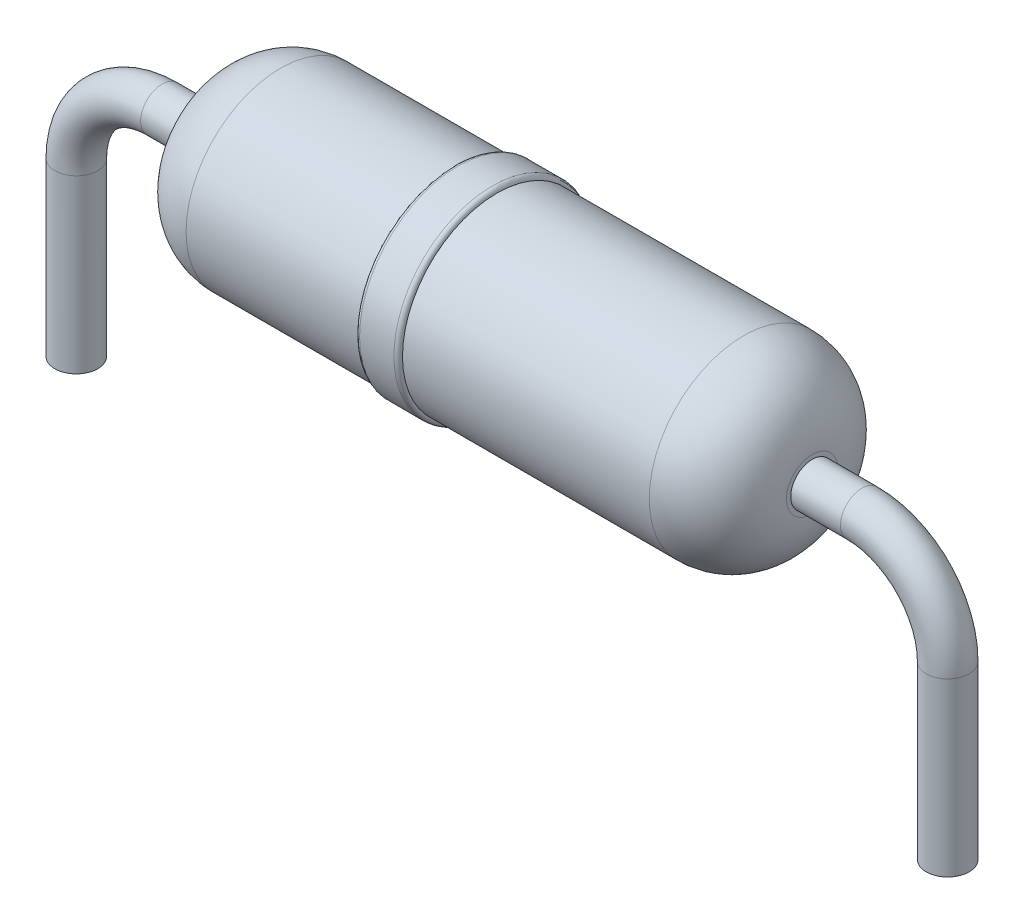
ISO-10303-21;
HEADER;
FILE_DESCRIPTION(('STEP AP214'),'2;1');
FILE_NAME('part.step','',(''),(''),'','','');
FILE_SCHEMA(('AUTOMOTIVE_DESIGN { 1 0 10303 214 1 1 1 1 }'));
ENDSEC;
DATA;
#1=APPLICATION_CONTEXT('core data for automotive mechanical design processes');
#2=APPLICATION_PROTOCOL_DEFINITION('international standard','automotive_design',2000,#1);
#3=PRODUCT_CONTEXT('',#1,'mechanical');
#4=PRODUCT('Part','Part','',(#3));
#5=PRODUCT_RELATED_PRODUCT_CATEGORY('part','',(#4));
#6=PRODUCT_DEFINITION_FORMATION('','',#4);
#7=PRODUCT_DEFINITION_CONTEXT('part definition',#1,'design');
#8=PRODUCT_DEFINITION('design','',#6,#7);
#9=PRODUCT_DEFINITION_SHAPE('','',#8);
#10=(LENGTH_UNIT() NAMED_UNIT(*) SI_UNIT(.MILLI.,.METRE.));
#11=(NAMED_UNIT(*) PLANE_ANGLE_UNIT() SI_UNIT($,.RADIAN.));
#12=(NAMED_UNIT(*) SI_UNIT($,.STERADIAN.) SOLID_ANGLE_UNIT());
#13=UNCERTAINTY_MEASURE_WITH_UNIT(LENGTH_MEASURE(1.E-05),#10,'distance_accuracy_value','');
#14=(GEOMETRIC_REPRESENTATION_CONTEXT(3) GLOBAL_UNCERTAINTY_ASSIGNED_CONTEXT((#13)) GLOBAL_UNIT_ASSIGNED_CONTEXT((#10,
#11,#12)) REPRESENTATION_CONTEXT('',''));
#15=CARTESIAN_POINT('',(0.,0.,0.));
#16=DIRECTION('',(0.,0.,1.));
#17=DIRECTION('',(1.,0.,0.));
#18=AXIS2_PLACEMENT_3D('',#15,#16,#17);
#19=CARTESIAN_POINT('',(-3.5,0.,0.));
#20=DIRECTION('',(1.,0.,0.));
#21=DIRECTION('',(0.,0.,-1.));
#22=AXIS2_PLACEMENT_3D('',#19,#20,#21);
#23=PLANE('',#22);
#24=CARTESIAN_POINT('',(-3.5,0.,0.));
#25=DIRECTION('',(-1.,0.,0.));
#26=DIRECTION('',(0.,0.,1.));
#27=AXIS2_PLACEMENT_3D('',#24,#25,#26);
#28=CIRCLE('',#27,0.299999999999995);
#29=CARTESIAN_POINT('',(-3.5,0.,0.299999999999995));
#30=VERTEX_POINT('',#29);
#31=EDGE_CURVE('E60',#30,#30,#28,.T.);
#32=ORIENTED_EDGE('',*,*,#31,.T.);
#33=EDGE_LOOP('',(#32));
#34=FACE_BOUND('',#33,.T.);
#35=CARTESIAN_POINT('',(-3.5,0.,0.));
#36=DIRECTION('',(1.,0.,0.));
#37=DIRECTION('',(0.,0.,-1.));
#38=AXIS2_PLACEMENT_3D('',#35,#36,#37);
#39=CIRCLE('',#38,0.25);
#40=CARTESIAN_POINT('',(-3.5,0.,-0.25));
#41=VERTEX_POINT('',#40);
#42=EDGE_CURVE('E10',#41,#41,#39,.F.);
#43=ORIENTED_EDGE('',*,*,#42,.F.);
#44=EDGE_LOOP('',(#43));
#45=FACE_BOUND('',#44,.T.);
#46=ADVANCED_FACE('F39',(#34,#45),#23,.F.);
#47=CARTESIAN_POINT('',(-54.2686615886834,0.,0.));
#48=DIRECTION('',(-1.,0.,0.));
#49=DIRECTION('',(0.,0.,1.));
#50=AXIS2_PLACEMENT_3D('',#47,#48,#49);
#51=CYLINDRICAL_SURFACE('',#50,1.1);
#52=CARTESIAN_POINT('',(-0.177024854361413,0.,0.));
#53=DIRECTION('',(1.,0.,0.));
#54=DIRECTION('',(0.,0.,-1.));
#55=AXIS2_PLACEMENT_3D('',#52,#53,#54);
#56=CIRCLE('',#55,1.1);
#57=CARTESIAN_POINT('',(-0.177024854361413,0.,-1.1));
#58=VERTEX_POINT('',#57);
#59=EDGE_CURVE('E57',#58,#58,#56,.T.);
#60=ORIENTED_EDGE('',*,*,#59,.T.);
#61=EDGE_LOOP('',(#60));
#62=FACE_BOUND('',#61,.T.);
#63=CARTESIAN_POINT('',(2.69999999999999,0.,0.));
#64=DIRECTION('',(-1.,0.,0.));
#65=DIRECTION('',(0.,0.,1.));
#66=AXIS2_PLACEMENT_3D('',#63,#64,#65);
#67=CIRCLE('',#66,1.1);
#68=CARTESIAN_POINT('',(2.69999999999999,0.,1.1));
#69=VERTEX_POINT('',#68);
#70=EDGE_CURVE('E67',#69,#69,#67,.T.);
#71=ORIENTED_EDGE('',*,*,#70,.T.);
#72=EDGE_LOOP('',(#71));
#73=FACE_BOUND('',#72,.T.);
#74=ADVANCED_FACE('F120',(#62,#73),#51,.T.);
#75=CARTESIAN_POINT('',(3.5,0.299999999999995,0.));
#76=DIRECTION('',(-1.,0.,0.));
#77=DIRECTION('',(0.,0.,1.));
#78=AXIS2_PLACEMENT_3D('',#75,#76,#77);
#79=PLANE('',#78);
#80=CARTESIAN_POINT('',(3.5,0.,0.));
#81=DIRECTION('',(-1.,0.,0.));
#82=DIRECTION('',(0.,0.,1.));
#83=AXIS2_PLACEMENT_3D('',#80,#81,#82);
#84=CIRCLE('',#83,0.25);
#85=CARTESIAN_POINT('',(3.5,0.,0.25));
#86=VERTEX_POINT('',#85);
#87=EDGE_CURVE('E90',#86,#86,#84,.T.);
#88=ORIENTED_EDGE('',*,*,#87,.T.);
#89=EDGE_LOOP('',(#88));
#90=FACE_BOUND('',#89,.T.);
#91=CARTESIAN_POINT('',(3.5,0.,0.));
#92=DIRECTION('',(-1.,0.,0.));
#93=DIRECTION('',(0.,0.,1.));
#94=AXIS2_PLACEMENT_3D('',#91,#92,#93);
#95=CIRCLE('',#94,0.299999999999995);
#96=CARTESIAN_POINT('',(3.5,0.,0.299999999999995));
#97=VERTEX_POINT('',#96);
#98=EDGE_CURVE('E54',#97,#97,#95,.T.);
#99=ORIENTED_EDGE('',*,*,#98,.F.);
#100=EDGE_LOOP('',(#99));
#101=FACE_BOUND('',#100,.T.);
#102=ADVANCED_FACE('F126',(#90,#101),#79,.F.);
#103=CARTESIAN_POINT('',(2.7,0.,0.));
#104=DIRECTION('',(-1.,0.,0.));
#105=DIRECTION('',(0.,0.,1.));
#106=AXIS2_PLACEMENT_3D('',#103,#104,#105);
#107=DEGENERATE_TOROIDAL_SURFACE('',#106,0.3,0.8,.T.);
#108=ORIENTED_EDGE('',*,*,#70,.F.);
#109=EDGE_LOOP('',(#108));
#110=FACE_BOUND('',#109,.T.);
#111=ORIENTED_EDGE('',*,*,#98,.T.);
#112=EDGE_LOOP('',(#111));
#113=FACE_BOUND('',#112,.T.);
#114=ADVANCED_FACE('F142',(#110,#113),#107,.T.);
#115=CARTESIAN_POINT('',(4.3261723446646,0.,0.));
#116=DIRECTION('',(1.,0.,0.));
#117=DIRECTION('',(0.,0.,-1.));
#118=AXIS2_PLACEMENT_3D('',#115,#116,#117);
#119=CYLINDRICAL_SURFACE('',#118,1.15);
#120=CARTESIAN_POINT('',(-0.627024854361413,0.,0.));
#121=DIRECTION('',(-1.,0.,0.));
#122=DIRECTION('',(0.,0.,1.));
#123=AXIS2_PLACEMENT_3D('',#120,#121,#122);
#124=CIRCLE('',#123,1.15);
#125=CARTESIAN_POINT('',(-0.627024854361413,0.,1.15));
#126=VERTEX_POINT('',#125);
#127=EDGE_CURVE('E46',#126,#126,#124,.F.);
#128=ORIENTED_EDGE('',*,*,#127,.T.);
#129=EDGE_LOOP('',(#128));
#130=FACE_BOUND('',#129,.T.);
#131=CARTESIAN_POINT('',(-0.227024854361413,0.,0.));
#132=DIRECTION('',(1.,0.,0.));
#133=DIRECTION('',(0.,0.,-1.));
#134=AXIS2_PLACEMENT_3D('',#131,#132,#133);
#135=CIRCLE('',#134,1.15);
#136=CARTESIAN_POINT('',(-0.227024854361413,0.,-1.15));
#137=VERTEX_POINT('',#136);
#138=EDGE_CURVE('E50',#137,#137,#135,.F.);
#139=ORIENTED_EDGE('',*,*,#138,.T.);
#140=EDGE_LOOP('',(#139));
#141=FACE_BOUND('',#140,.T.);
#142=ADVANCED_FACE('F133',(#130,#141),#119,.T.);
#143=CARTESIAN_POINT('',(-2.7,0.,0.));
#144=DIRECTION('',(-1.,0.,0.));
#145=DIRECTION('',(0.,0.,1.));
#146=AXIS2_PLACEMENT_3D('',#143,#144,#145);
#147=DEGENERATE_TOROIDAL_SURFACE('',#146,0.3,0.8,.T.);
#148=ORIENTED_EDGE('',*,*,#31,.F.);
#149=EDGE_LOOP('',(#148));
#150=FACE_BOUND('',#149,.T.);
#151=CARTESIAN_POINT('',(-2.69999999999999,0.,0.));
#152=DIRECTION('',(-1.,0.,0.));
#153=DIRECTION('',(0.,0.,1.));
#154=AXIS2_PLACEMENT_3D('',#151,#152,#153);
#155=CIRCLE('',#154,1.1);
#156=CARTESIAN_POINT('',(-2.69999999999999,0.,1.1));
#157=VERTEX_POINT('',#156);
#158=EDGE_CURVE('E70',#157,#157,#155,.T.);
#159=ORIENTED_EDGE('',*,*,#158,.T.);
#160=EDGE_LOOP('',(#159));
#161=FACE_BOUND('',#160,.T.);
#162=ADVANCED_FACE('F135',(#150,#161),#147,.T.);
#163=CARTESIAN_POINT('',(-0.677024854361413,0.,0.));
#164=DIRECTION('',(-1.,0.,0.));
#165=DIRECTION('',(0.,0.,1.));
#166=AXIS2_PLACEMENT_3D('',#163,#164,#165);
#167=CIRCLE('',#166,1.1);
#168=CARTESIAN_POINT('',(-0.677024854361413,0.,1.1));
#169=VERTEX_POINT('',#168);
#170=EDGE_CURVE('E61',#169,#169,#167,.T.);
#171=ORIENTED_EDGE('',*,*,#170,.T.);
#172=EDGE_LOOP('',(#171));
#173=FACE_BOUND('',#172,.T.);
#174=ORIENTED_EDGE('',*,*,#158,.F.);
#175=EDGE_LOOP('',(#174));
#176=FACE_BOUND('',#175,.T.);
#177=ADVANCED_FACE('F129',(#173,#176),#51,.T.);
#178=CARTESIAN_POINT('',(-0.627024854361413,0.,0.));
#179=DIRECTION('',(-1.,0.,0.));
#180=DIRECTION('',(0.,0.,1.));
#181=AXIS2_PLACEMENT_3D('',#178,#179,#180);
#182=TOROIDAL_SURFACE('',#181,1.1,0.05);
#183=ORIENTED_EDGE('',*,*,#170,.F.);
#184=EDGE_LOOP('',(#183));
#185=FACE_BOUND('',#184,.T.);
#186=ORIENTED_EDGE('',*,*,#127,.F.);
#187=EDGE_LOOP('',(#186));
#188=FACE_BOUND('',#187,.T.);
#189=ADVANCED_FACE('F140',(#185,#188),#182,.T.);
#190=CARTESIAN_POINT('',(-0.227024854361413,0.,0.));
#191=DIRECTION('',(1.,0.,0.));
#192=DIRECTION('',(0.,0.,-1.));
#193=AXIS2_PLACEMENT_3D('',#190,#191,#192);
#194=TOROIDAL_SURFACE('',#193,1.1,0.05);
#195=ORIENTED_EDGE('',*,*,#138,.F.);
#196=EDGE_LOOP('',(#195));
#197=FACE_BOUND('',#196,.T.);
#198=ORIENTED_EDGE('',*,*,#59,.F.);
#199=EDGE_LOOP('',(#198));
#200=FACE_BOUND('',#199,.T.);
#201=ADVANCED_FACE('F41',(#197,#200),#194,.T.);
#202=CARTESIAN_POINT('',(-5.08,-0.999999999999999,0.));
#203=DIRECTION('',(0.,-1.,0.));
#204=DIRECTION('',(0.,0.,-1.));
#205=AXIS2_PLACEMENT_3D('',#202,#203,#204);
#206=CYLINDRICAL_SURFACE('',#205,0.25);
#207=CARTESIAN_POINT('',(-5.08,-0.999999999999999,0.));
#208=DIRECTION('',(0.,-1.,0.));
#209=DIRECTION('',(0.,0.,1.));
#210=AXIS2_PLACEMENT_3D('',#207,#208,#209);
#211=CIRCLE('',#210,0.25);
#212=CARTESIAN_POINT('',(-5.33,-0.999999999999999,0.));
#213=VERTEX_POINT('',#212);
#214=EDGE_CURVE('E77',#213,#213,#211,.T.);
#215=ORIENTED_EDGE('',*,*,#214,.T.);
#216=EDGE_LOOP('',(#215));
#217=FACE_BOUND('',#216,.T.);
#218=CARTESIAN_POINT('',(-5.08,-3.,0.));
#219=DIRECTION('',(0.,-1.,0.));
#220=DIRECTION('',(0.,0.,1.));
#221=AXIS2_PLACEMENT_3D('',#218,#219,#220);
#222=CIRCLE('',#221,0.25);
#223=CARTESIAN_POINT('',(-5.08,-3.,0.25));
#224=VERTEX_POINT('',#223);
#225=EDGE_CURVE('E64',#224,#224,#222,.T.);
#226=ORIENTED_EDGE('',*,*,#225,.F.);
#227=EDGE_LOOP('',(#226));
#228=FACE_BOUND('',#227,.T.);
#229=ADVANCED_FACE('F153',(#217,#228),#206,.T.);
#230=CARTESIAN_POINT('',(-4.08,-1.,0.));
#231=DIRECTION('',(0.,0.,1.));
#232=DIRECTION('',(1.,0.,0.));
#233=AXIS2_PLACEMENT_3D('',#230,#231,#232);
#234=TOROIDAL_SURFACE('',#233,0.999999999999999,0.25);
#235=CARTESIAN_POINT('',(-4.08,0.,0.));
#236=DIRECTION('',(-1.,0.,0.));
#237=DIRECTION('',(0.,0.,1.));
#238=AXIS2_PLACEMENT_3D('',#235,#236,#237);
#239=CIRCLE('',#238,0.25);
#240=CARTESIAN_POINT('',(-4.08,0.25,0.));
#241=VERTEX_POINT('',#240);
#242=EDGE_CURVE('E80',#241,#241,#239,.T.);
#243=CARTESIAN_POINT('',(-4.08,-1.,0.));
#244=DIRECTION('',(0.,0.,1.));
#245=DIRECTION('',(1.,0.,0.));
#246=AXIS2_PLACEMENT_3D('',#243,#244,#245);
#247=CIRCLE('',#246,1.25);
#248=EDGE_CURVE('',#241,#213,#247,.T.);
#249=ORIENTED_EDGE('',*,*,#242,.T.);
#250=ORIENTED_EDGE('',*,*,#214,.F.);
#251=ORIENTED_EDGE('',*,*,#248,.T.);
#252=ORIENTED_EDGE('',*,*,#248,.F.);
#253=EDGE_LOOP('',(#249,#251,#250,#252));
#254=FACE_BOUND('',#253,.T.);
#255=ADVANCED_FACE('F163',(#254),#234,.T.);
#256=CARTESIAN_POINT('',(-4.08,0.,0.));
#257=DIRECTION('',(1.,0.,0.));
#258=DIRECTION('',(0.,1.,0.));
#259=AXIS2_PLACEMENT_3D('',#256,#257,#258);
#260=CYLINDRICAL_SURFACE('',#259,0.25);
#261=ORIENTED_EDGE('',*,*,#242,.F.);
#262=EDGE_LOOP('',(#261));
#263=FACE_BOUND('',#262,.T.);
#264=ORIENTED_EDGE('',*,*,#42,.T.);
#265=EDGE_LOOP('',(#264));
#266=FACE_BOUND('',#265,.T.);
#267=ADVANCED_FACE('F228',(#263,#266),#260,.T.);
#268=CARTESIAN_POINT('',(-5.08,-3.,0.));
#269=DIRECTION('',(0.,-1.,0.));
#270=DIRECTION('',(0.,0.,1.));
#271=AXIS2_PLACEMENT_3D('',#268,#269,#270);
#272=PLANE('',#271);
#273=ORIENTED_EDGE('',*,*,#225,.T.);
#274=EDGE_LOOP('',(#273));
#275=FACE_BOUND('',#274,.T.);
#276=ADVANCED_FACE('F108',(#275),#272,.T.);
#277=CARTESIAN_POINT('',(5.08,-0.999999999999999,0.));
#278=DIRECTION('',(0.,-1.,0.));
#279=DIRECTION('',(0.,0.,-1.));
#280=AXIS2_PLACEMENT_3D('',#277,#278,#279);
#281=CYLINDRICAL_SURFACE('',#280,0.25);
#282=CARTESIAN_POINT('',(5.08,-0.999999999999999,0.));
#283=DIRECTION('',(0.,1.,0.));
#284=DIRECTION('',(0.,0.,1.));
#285=AXIS2_PLACEMENT_3D('',#282,#283,#284);
#286=CIRCLE('',#285,0.25);
#287=CARTESIAN_POINT('',(5.33,-0.999999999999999,0.));
#288=VERTEX_POINT('',#287);
#289=EDGE_CURVE('E86',#288,#288,#286,.T.);
#290=ORIENTED_EDGE('',*,*,#289,.F.);
#291=EDGE_LOOP('',(#290));
#292=FACE_BOUND('',#291,.T.);
#293=CARTESIAN_POINT('',(5.08,-3.,0.));
#294=DIRECTION('',(0.,1.,0.));
#295=DIRECTION('',(0.,0.,1.));
#296=AXIS2_PLACEMENT_3D('',#293,#294,#295);
#297=CIRCLE('',#296,0.25);
#298=CARTESIAN_POINT('',(5.08,-3.,0.25));
#299=VERTEX_POINT('',#298);
#300=EDGE_CURVE('E83',#299,#299,#297,.T.);
#301=ORIENTED_EDGE('',*,*,#300,.T.);
#302=EDGE_LOOP('',(#301));
#303=FACE_BOUND('',#302,.T.);
#304=ADVANCED_FACE('F102',(#292,#303),#281,.T.);
#305=CARTESIAN_POINT('',(4.08,-1.,0.));
#306=DIRECTION('',(0.,0.,-1.));
#307=DIRECTION('',(-1.,0.,0.));
#308=AXIS2_PLACEMENT_3D('',#305,#306,#307);
#309=TOROIDAL_SURFACE('',#308,0.999999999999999,0.25);
#310=CARTESIAN_POINT('',(4.08,0.,0.));
#311=DIRECTION('',(-1.,0.,0.));
#312=DIRECTION('',(0.,0.,1.));
#313=AXIS2_PLACEMENT_3D('',#310,#311,#312);
#314=CIRCLE('',#313,0.25);
#315=CARTESIAN_POINT('',(4.08,0.25,0.));
#316=VERTEX_POINT('',#315);
#317=EDGE_CURVE('E89',#316,#316,#314,.T.);
#318=CARTESIAN_POINT('',(4.08,-1.,0.));
#319=DIRECTION('',(0.,0.,-1.));
#320=DIRECTION('',(-1.,0.,0.));
#321=AXIS2_PLACEMENT_3D('',#318,#319,#320);
#322=CIRCLE('',#321,1.25);
#323=EDGE_CURVE('',#316,#288,#322,.T.);
#324=ORIENTED_EDGE('',*,*,#317,.F.);
#325=ORIENTED_EDGE('',*,*,#289,.T.);
#326=ORIENTED_EDGE('',*,*,#323,.T.);
#327=ORIENTED_EDGE('',*,*,#323,.F.);
#328=EDGE_LOOP('',(#324,#326,#325,#327));
#329=FACE_BOUND('',#328,.T.);
#330=ADVANCED_FACE('F99',(#329),#309,.T.);
#331=CARTESIAN_POINT('',(4.08,0.,0.));
#332=DIRECTION('',(-1.,0.,0.));
#333=DIRECTION('',(0.,-1.,0.));
#334=AXIS2_PLACEMENT_3D('',#331,#332,#333);
#335=CYLINDRICAL_SURFACE('',#334,0.25);
#336=ORIENTED_EDGE('',*,*,#317,.T.);
#337=EDGE_LOOP('',(#336));
#338=FACE_BOUND('',#337,.T.);
#339=ORIENTED_EDGE('',*,*,#87,.F.);
#340=EDGE_LOOP('',(#339));
#341=FACE_BOUND('',#340,.T.);
#342=ADVANCED_FACE('F96',(#338,#341),#335,.T.);
#343=CARTESIAN_POINT('',(5.08,-3.,0.));
#344=DIRECTION('',(0.,-1.,0.));
#345=DIRECTION('',(0.,0.,1.));
#346=AXIS2_PLACEMENT_3D('',#343,#344,#345);
#347=PLANE('',#346);
#348=ORIENTED_EDGE('',*,*,#300,.F.);
#349=EDGE_LOOP('',(#348));
#350=FACE_BOUND('',#349,.T.);
#351=ADVANCED_FACE('F112',(#350),#347,.T.);
#352=CLOSED_SHELL('',(#46,#74,#102,#114,#142,#162,#177,#189,#201,#229,#255,#267,#276,#304,#330,
#342,#351));
#353=MANIFOLD_SOLID_BREP('B2',#352);
#354=ADVANCED_BREP_SHAPE_REPRESENTATION('',(#18,#353),#14);
#355=SHAPE_DEFINITION_REPRESENTATION(#9,#354);
ENDSEC;
END-ISO-10303-21;
